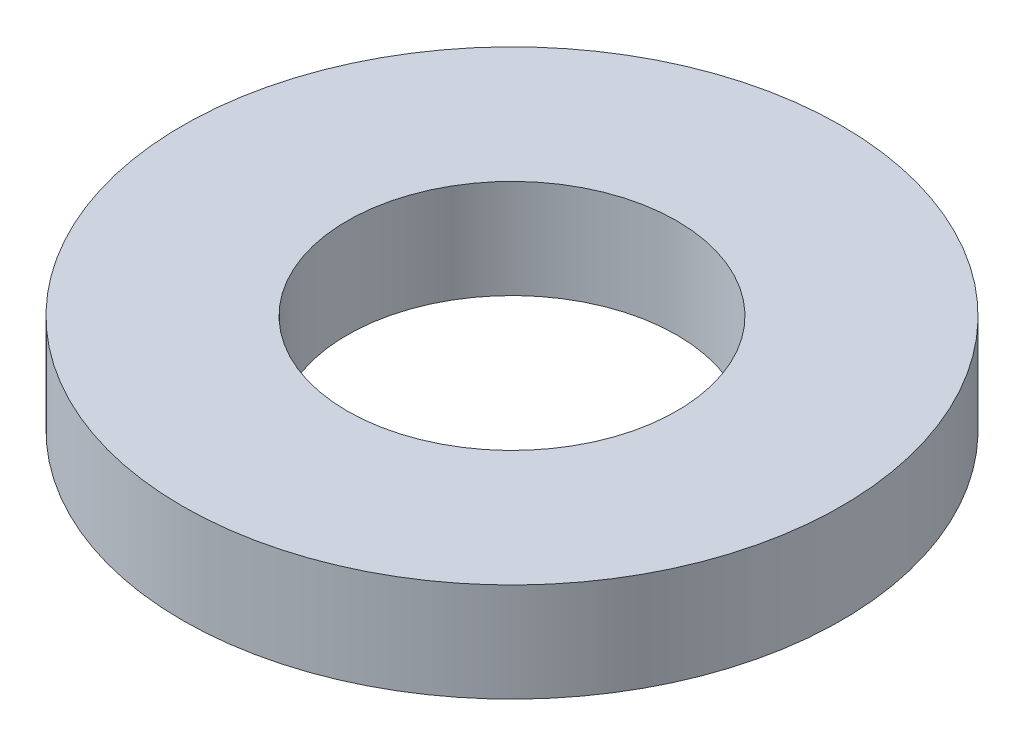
from build123d import *

# Parameters (mm, degrees)
SKETCH1_R           = 100
SKETCH1_R_2         = 50
BOSS_EXTRUDE1_DEPTH = 15


with BuildPart() as part:
    # Sketch1 → Boss-Extrude1 (new, symmetric)
    with BuildSketch(Plane(origin=(0, 0, 0), x_dir=(1, 0, 0), z_dir=(0, 1, 0))):
        with Locations(Location((0, 0, 0), (0, 0, 270))):
            Circle(SKETCH1_R)
        with Locations(Location((0, 0, 0), (0, 0, 270))):
            Circle(SKETCH1_R_2, mode=Mode.SUBTRACT)
    extrude(amount=BOSS_EXTRUDE1_DEPTH, both=True)


solid = part.part
